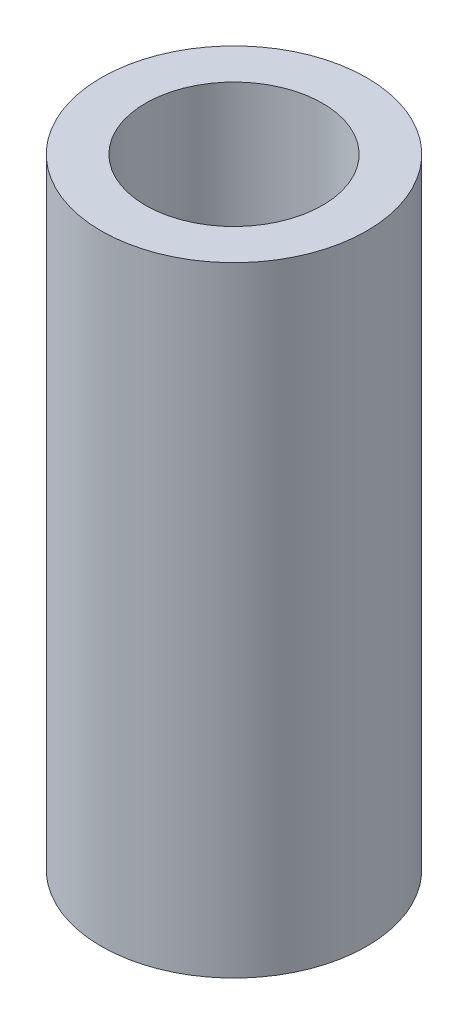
from build123d import *

# Parameters (mm, degrees)
SKETCH_1_R      = 7.5
SKETCH_1_R_2    = 5
EXTRUDE_1_DEPTH = 35


with BuildPart() as part:
    # Sketch 1 → Extrude 1 (new body)
    with BuildSketch(Plane(origin=(0, 0, 0), x_dir=(1, 0, 0), z_dir=(0, 1, 0))):
        with Locations(Location((0, 0, 0), (0, 0, 270))):
            Circle(SKETCH_1_R)
        with Locations(Location((0, 0, 0), (0, 0, 270))):
            Circle(SKETCH_1_R_2, mode=Mode.SUBTRACT)
    extrude(amount=EXTRUDE_1_DEPTH)


solid = part.part
